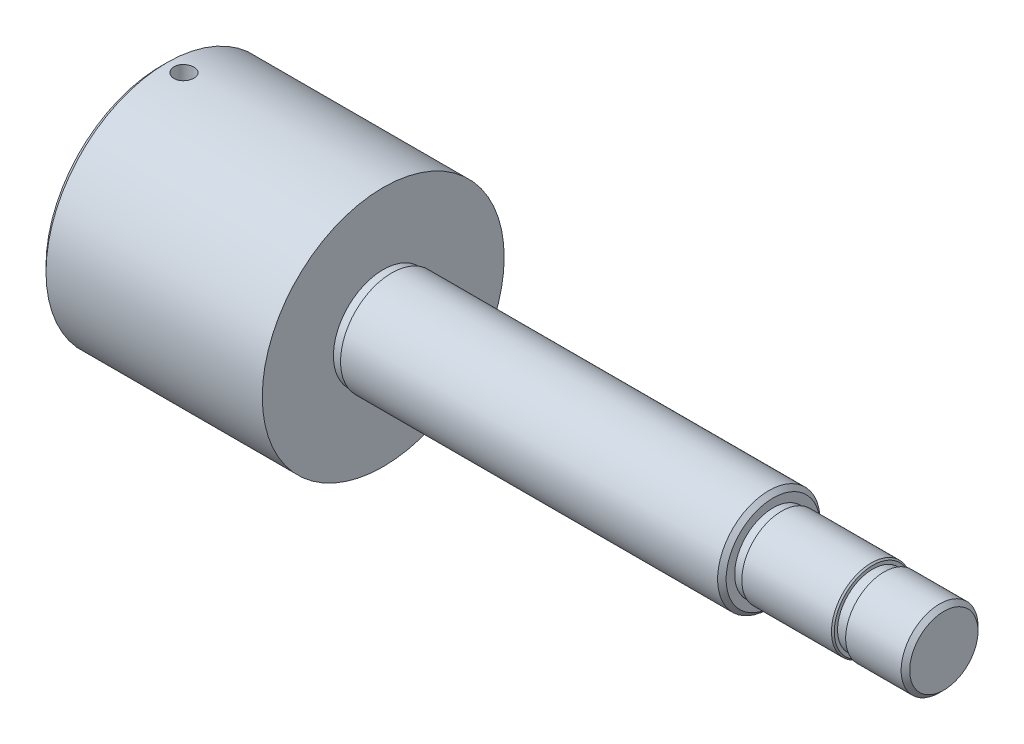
from build123d import *

# Parameters (mm, degrees)
CHAMFER_6_SIZE = 2
CHAMFER_1_SIZE = 1.5
CHAMFER_4_SIZE = 2
SKETCH_8_W     = 3.5
SKETCH_8_H     = 42.5
CHAMFER_5_SIZE = 0.5


with BuildPart() as part:
    # Sketch 1 → Revolve 1 (revolve)
    with BuildSketch(Plane.XY, mode=Mode.PRIVATE) as revolve_1_sk:
        Polygon((0, 33), (14, 33), (14, 34.25), (18, 34.25), (18, 31), (53, 31), (53, 22.5), (71, 22.5), (71, 0), (275, 0), (275, 13.5), (254, 13.5), (254, 12.35), (250, 12.35), (250, 14), (218, 14), (218, 13.5), (215, 13.5), (215, 14), (215, 18), (81, 18), (81, 17.5), (78, 17.5), (78, 42.5), (0, 42.5), align=None)
    revolve(revolve_1_sk.sketch.rotate(Axis((0, 0, 0), (-1, 0, 0)), 90), axis=Axis((0, 0, 0), (-1, 0, 0)))

    # Chamfer 6
    chamfer_6_edges = [part.edges().sort_by_distance(p)[0] for p in [
        (0, 0, 33),
    ]]
    chamfer(chamfer_6_edges, length=CHAMFER_6_SIZE)

    # Chamfer 1
    chamfer_1_edges = [part.edges().sort_by_distance(p)[0] for p in [
        (275, 0, 13.5),
        (215, 0, 18),
    ]]
    chamfer(chamfer_1_edges, length=CHAMFER_1_SIZE)

    # Chamfer 4
    chamfer_4_edges = [part.edges().sort_by_distance(p)[0] for p in [
        (0, 0, 42.5),
    ]]
    chamfer(chamfer_4_edges, length=CHAMFER_4_SIZE)

    # Sketch 8 → M8x1.0 _1 (revolve, cut)
    with BuildSketch(Plane(origin=(8, 0, 0), x_dir=(0, 0, -1), z_dir=(1, 0, 0))):
        with Locations((1.75, 21.25)):
            Rectangle(SKETCH_8_W, SKETCH_8_H)
    m8x1_0_1 = revolve(axis=Axis((8, -6.35, 0), (0, 1, 0)), mode=Mode.SUBTRACT)

    # Mirror 1: M8x1.0 _1 across plane
    add(m8x1_0_1.mirror(Plane.ZX), mode=Mode.SUBTRACT)

    # Chamfer 5
    chamfer_5_edges = [part.edges().sort_by_distance(p)[0] for p in [
        (250, 0, 14),
    ]]
    chamfer(chamfer_5_edges, length=CHAMFER_5_SIZE)


solid = part.part
